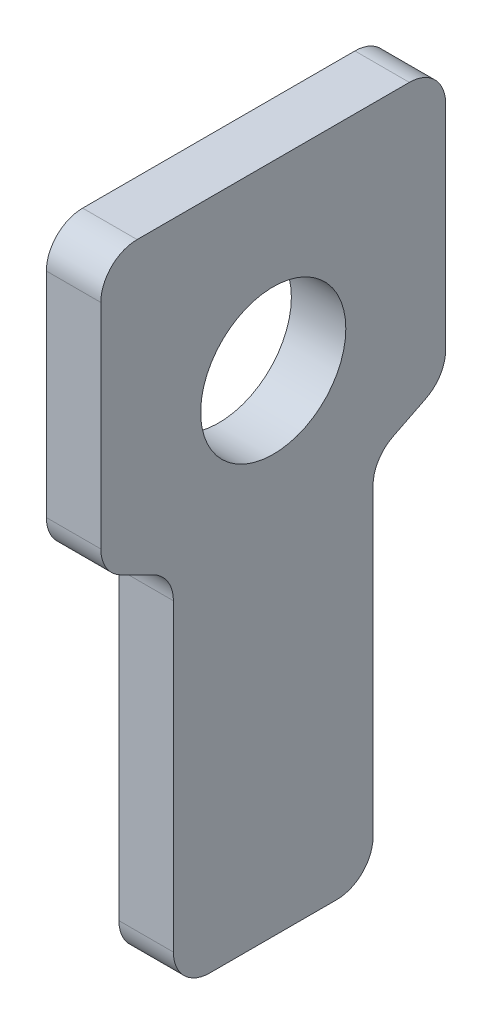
from build123d import *

# Parameters (mm, degrees)
SKETCH1_R           = 4
BOSS_EXTRUDE1_DEPTH = 3
FILLET1_R           = 2


with BuildPart() as part:
    # Sketch1 → Boss-Extrude1 (new body)
    with BuildSketch(Plane(origin=(0, 0, 0), x_dir=(0, 0, -1), z_dir=(1, 0, 0))):
        Polygon((9.5, 10), (9.5, -5), (5.5, -7), (5.5, -27), (-5.5, -27), (-5.5, -7), (-9.5, -5), (-9.5, 10), align=None)
        Circle(SKETCH1_R, mode=Mode.SUBTRACT)
    extrude(amount=BOSS_EXTRUDE1_DEPTH)

    # Fillet1
    fillet1_edges = [part.edges().sort_by_distance(p)[0] for p in [
        (1.5, 10, -9.5),
        (1.5, -5, -9.5),
        (1.5, -7, -5.5),
        (1.5, -27, -5.5),
        (1.5, -27, 5.5),
        (1.5, -7, 5.5),
        (1.5, -5, 9.5),
        (1.5, 10, 9.5),
    ]]
    fillet(fillet1_edges, radius=FILLET1_R)


solid = part.part
